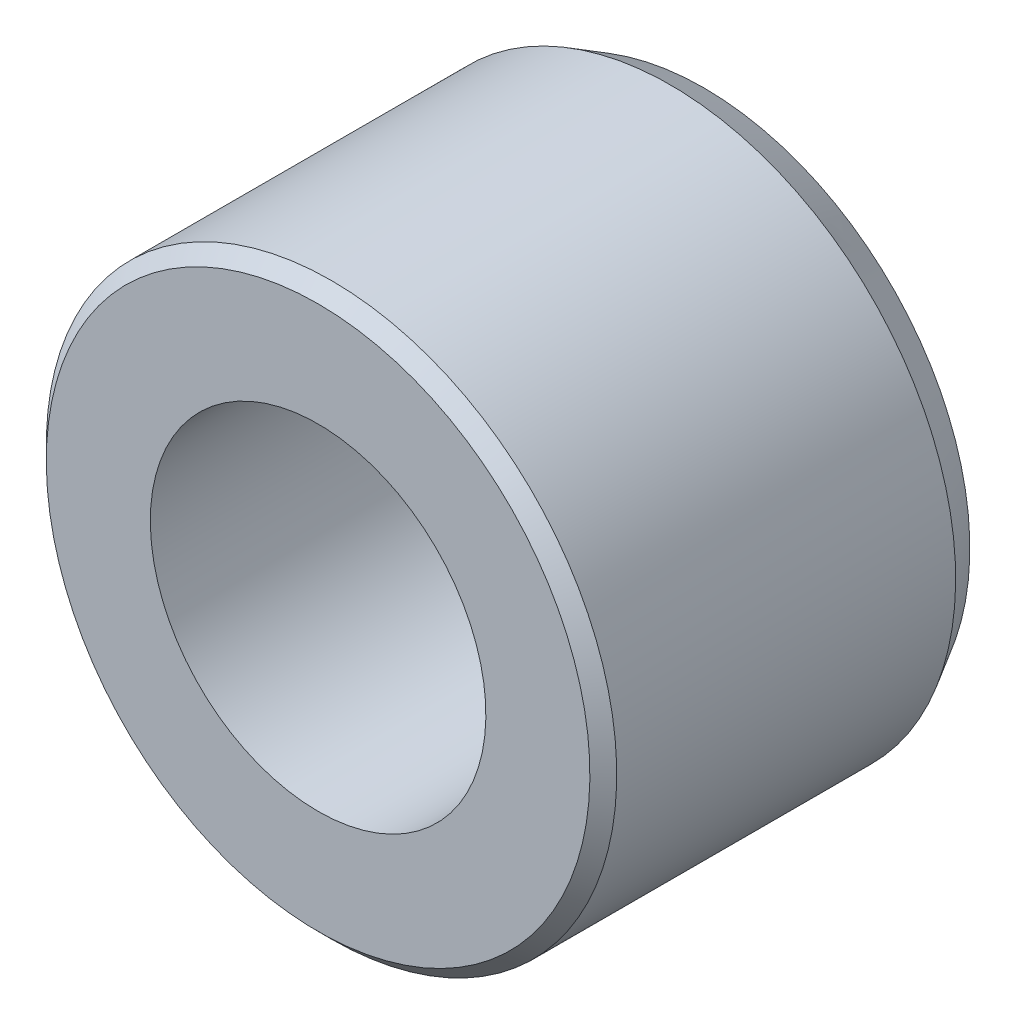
ISO-10303-21;
HEADER;
FILE_DESCRIPTION(('STEP AP214'),'2;1');
FILE_NAME('part.step','',(''),(''),'','','');
FILE_SCHEMA(('AUTOMOTIVE_DESIGN { 1 0 10303 214 1 1 1 1 }'));
ENDSEC;
DATA;
#1=APPLICATION_CONTEXT('core data for automotive mechanical design processes');
#2=APPLICATION_PROTOCOL_DEFINITION('international standard','automotive_design',2000,#1);
#3=PRODUCT_CONTEXT('',#1,'mechanical');
#4=PRODUCT('Part','Part','',(#3));
#5=PRODUCT_RELATED_PRODUCT_CATEGORY('part','',(#4));
#6=PRODUCT_DEFINITION_FORMATION('','',#4);
#7=PRODUCT_DEFINITION_CONTEXT('part definition',#1,'design');
#8=PRODUCT_DEFINITION('design','',#6,#7);
#9=PRODUCT_DEFINITION_SHAPE('','',#8);
#10=(LENGTH_UNIT() NAMED_UNIT(*) SI_UNIT(.MILLI.,.METRE.));
#11=(NAMED_UNIT(*) PLANE_ANGLE_UNIT() SI_UNIT($,.RADIAN.));
#12=(NAMED_UNIT(*) SI_UNIT($,.STERADIAN.) SOLID_ANGLE_UNIT());
#13=UNCERTAINTY_MEASURE_WITH_UNIT(LENGTH_MEASURE(1.E-05),#10,'distance_accuracy_value','');
#14=(GEOMETRIC_REPRESENTATION_CONTEXT(3) GLOBAL_UNCERTAINTY_ASSIGNED_CONTEXT((#13)) GLOBAL_UNIT_ASSIGNED_CONTEXT((#10,
#11,#12)) REPRESENTATION_CONTEXT('',''));
#15=CARTESIAN_POINT('',(0.,0.,0.));
#16=DIRECTION('',(0.,0.,1.));
#17=DIRECTION('',(1.,0.,0.));
#18=AXIS2_PLACEMENT_3D('',#15,#16,#17);
#19=CARTESIAN_POINT('',(0.,0.,-11.5));
#20=DIRECTION('',(0.,0.,1.));
#21=DIRECTION('',(0.,-1.,0.));
#22=AXIS2_PLACEMENT_3D('',#19,#20,#21);
#23=CYLINDRICAL_SURFACE('',#22,5.);
#24=CARTESIAN_POINT('',(0.,0.,0.));
#25=DIRECTION('',(0.,0.,1.));
#26=DIRECTION('',(0.,-1.,0.));
#27=AXIS2_PLACEMENT_3D('',#24,#25,#26);
#28=CIRCLE('',#27,5.);
#29=CARTESIAN_POINT('',(0.,-5.,0.));
#30=VERTEX_POINT('',#29);
#31=EDGE_CURVE('E15',#30,#30,#28,.F.);
#32=ORIENTED_EDGE('',*,*,#31,.F.);
#33=EDGE_LOOP('',(#32));
#34=FACE_BOUND('',#33,.T.);
#35=CARTESIAN_POINT('',(0.,0.,-11.5));
#36=DIRECTION('',(0.,0.,1.));
#37=DIRECTION('',(0.,-1.,0.));
#38=AXIS2_PLACEMENT_3D('',#35,#36,#37);
#39=CIRCLE('',#38,5.);
#40=CARTESIAN_POINT('',(0.,-5.,-11.5));
#41=VERTEX_POINT('',#40);
#42=EDGE_CURVE('E35',#41,#41,#39,.T.);
#43=ORIENTED_EDGE('',*,*,#42,.F.);
#44=EDGE_LOOP('',(#43));
#45=FACE_BOUND('',#44,.T.);
#46=ADVANCED_FACE('F12',(#34,#45),#23,.F.);
#47=CARTESIAN_POINT('',(8.1,0.,0.));
#48=DIRECTION('',(0.,0.,1.));
#49=DIRECTION('',(0.,-1.,0.));
#50=AXIS2_PLACEMENT_3D('',#47,#48,#49);
#51=PLANE('',#50);
#52=CARTESIAN_POINT('',(0.,0.,0.));
#53=DIRECTION('',(0.,0.,-1.));
#54=DIRECTION('',(0.,1.,0.));
#55=AXIS2_PLACEMENT_3D('',#52,#53,#54);
#56=CIRCLE('',#55,8.1);
#57=CARTESIAN_POINT('',(0.,8.1,0.));
#58=VERTEX_POINT('',#57);
#59=EDGE_CURVE('E33',#58,#58,#56,.T.);
#60=ORIENTED_EDGE('',*,*,#59,.F.);
#61=EDGE_LOOP('',(#60));
#62=FACE_BOUND('',#61,.T.);
#63=ORIENTED_EDGE('',*,*,#31,.T.);
#64=EDGE_LOOP('',(#63));
#65=FACE_BOUND('',#64,.T.);
#66=ADVANCED_FACE('F42',(#62,#65),#51,.T.);
#67=CARTESIAN_POINT('',(5.,0.,-11.5));
#68=DIRECTION('',(0.,0.,-1.));
#69=DIRECTION('',(0.,1.,0.));
#70=AXIS2_PLACEMENT_3D('',#67,#68,#69);
#71=PLANE('',#70);
#72=ORIENTED_EDGE('',*,*,#42,.T.);
#73=EDGE_LOOP('',(#72));
#74=FACE_BOUND('',#73,.T.);
#75=CARTESIAN_POINT('',(0.,0.,-11.5));
#76=DIRECTION('',(0.,0.,1.));
#77=DIRECTION('',(0.,-1.,0.));
#78=AXIS2_PLACEMENT_3D('',#75,#76,#77);
#79=CIRCLE('',#78,7.92264973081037);
#80=CARTESIAN_POINT('',(0.,-7.92264973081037,-11.5));
#81=VERTEX_POINT('',#80);
#82=EDGE_CURVE('E24',#81,#81,#79,.T.);
#83=ORIENTED_EDGE('',*,*,#82,.F.);
#84=EDGE_LOOP('',(#83));
#85=FACE_BOUND('',#84,.T.);
#86=ADVANCED_FACE('F50',(#74,#85),#71,.T.);
#87=CARTESIAN_POINT('',(0.,0.,-0.4));
#88=DIRECTION('',(0.,0.,-1.));
#89=DIRECTION('',(0.,1.,0.));
#90=AXIS2_PLACEMENT_3D('',#87,#88,#89);
#91=CONICAL_SURFACE('',#90,8.5,0.785398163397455);
#92=CARTESIAN_POINT('',(0.,0.,-0.4));
#93=DIRECTION('',(0.,0.,1.));
#94=DIRECTION('',(0.,-1.,0.));
#95=AXIS2_PLACEMENT_3D('',#92,#93,#94);
#96=CIRCLE('',#95,8.5);
#97=CARTESIAN_POINT('',(0.,-8.5,-0.4));
#98=VERTEX_POINT('',#97);
#99=EDGE_CURVE('E19',#98,#98,#96,.F.);
#100=ORIENTED_EDGE('',*,*,#99,.F.);
#101=EDGE_LOOP('',(#100));
#102=FACE_BOUND('',#101,.T.);
#103=ORIENTED_EDGE('',*,*,#59,.T.);
#104=EDGE_LOOP('',(#103));
#105=FACE_BOUND('',#104,.T.);
#106=ADVANCED_FACE('F59',(#102,#105),#91,.T.);
#107=CARTESIAN_POINT('',(0.,0.,-10.5));
#108=DIRECTION('',(0.,0.,1.));
#109=DIRECTION('',(0.,-1.,0.));
#110=AXIS2_PLACEMENT_3D('',#107,#108,#109);
#111=CONICAL_SURFACE('',#110,8.5,0.523598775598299);
#112=ORIENTED_EDGE('',*,*,#82,.T.);
#113=EDGE_LOOP('',(#112));
#114=FACE_BOUND('',#113,.T.);
#115=CARTESIAN_POINT('',(0.,0.,-10.5));
#116=DIRECTION('',(0.,0.,1.));
#117=DIRECTION('',(0.,-1.,0.));
#118=AXIS2_PLACEMENT_3D('',#115,#116,#117);
#119=CIRCLE('',#118,8.5);
#120=CARTESIAN_POINT('',(0.,-8.5,-10.5));
#121=VERTEX_POINT('',#120);
#122=EDGE_CURVE('E8',#121,#121,#119,.T.);
#123=ORIENTED_EDGE('',*,*,#122,.F.);
#124=EDGE_LOOP('',(#123));
#125=FACE_BOUND('',#124,.T.);
#126=ADVANCED_FACE('F54',(#114,#125),#111,.T.);
#127=CARTESIAN_POINT('',(0.,0.,-11.5));
#128=DIRECTION('',(0.,0.,1.));
#129=DIRECTION('',(0.,-1.,0.));
#130=AXIS2_PLACEMENT_3D('',#127,#128,#129);
#131=CYLINDRICAL_SURFACE('',#130,8.5);
#132=ORIENTED_EDGE('',*,*,#122,.T.);
#133=EDGE_LOOP('',(#132));
#134=FACE_BOUND('',#133,.T.);
#135=ORIENTED_EDGE('',*,*,#99,.T.);
#136=EDGE_LOOP('',(#135));
#137=FACE_BOUND('',#136,.T.);
#138=ADVANCED_FACE('F52',(#134,#137),#131,.T.);
#139=CLOSED_SHELL('',(#46,#66,#86,#106,#126,#138));
#140=MANIFOLD_SOLID_BREP('B1',#139);
#141=ADVANCED_BREP_SHAPE_REPRESENTATION('',(#18,#140),#14);
#142=SHAPE_DEFINITION_REPRESENTATION(#9,#141);
ENDSEC;
END-ISO-10303-21;
